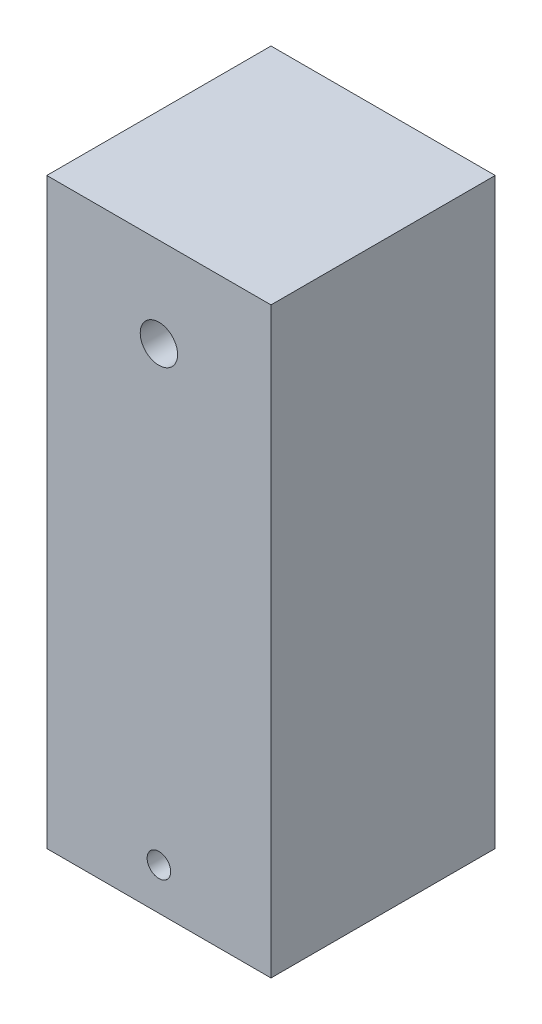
from build123d import *

# Parameters (mm, degrees)
SKETCH1_W           = 19.05
SKETCH1_H           = 49.53
SKETCH1_R           = 1.5875
BOSS_EXTRUDE1_DEPTH = 19.05
SKETCH3_R           = 1
CUT_EXTRUDE2_DEPTH  = 33.66394572


with BuildPart() as part:
    # Sketch1 → Boss-Extrude1 (new body)
    with BuildSketch(Plane.XY):
        Rectangle(SKETCH1_W, SKETCH1_H)
        with Locations(Location((0, 17.145, 0), (0, 0, 180))):
            Circle(SKETCH1_R, mode=Mode.SUBTRACT)
    extrude(amount=BOSS_EXTRUDE1_DEPTH)

    # Sketch3 → Cut-Extrude2 (cut, through all)
    with BuildSketch(Plane(origin=(0, 0, 0), x_dir=(-1, 0, 0), z_dir=(0, 0, -1))):
        with Locations((0, -21.209)):
            Circle(SKETCH3_R)
    extrude(amount=-CUT_EXTRUDE2_DEPTH, mode=Mode.SUBTRACT)


solid = part.part
